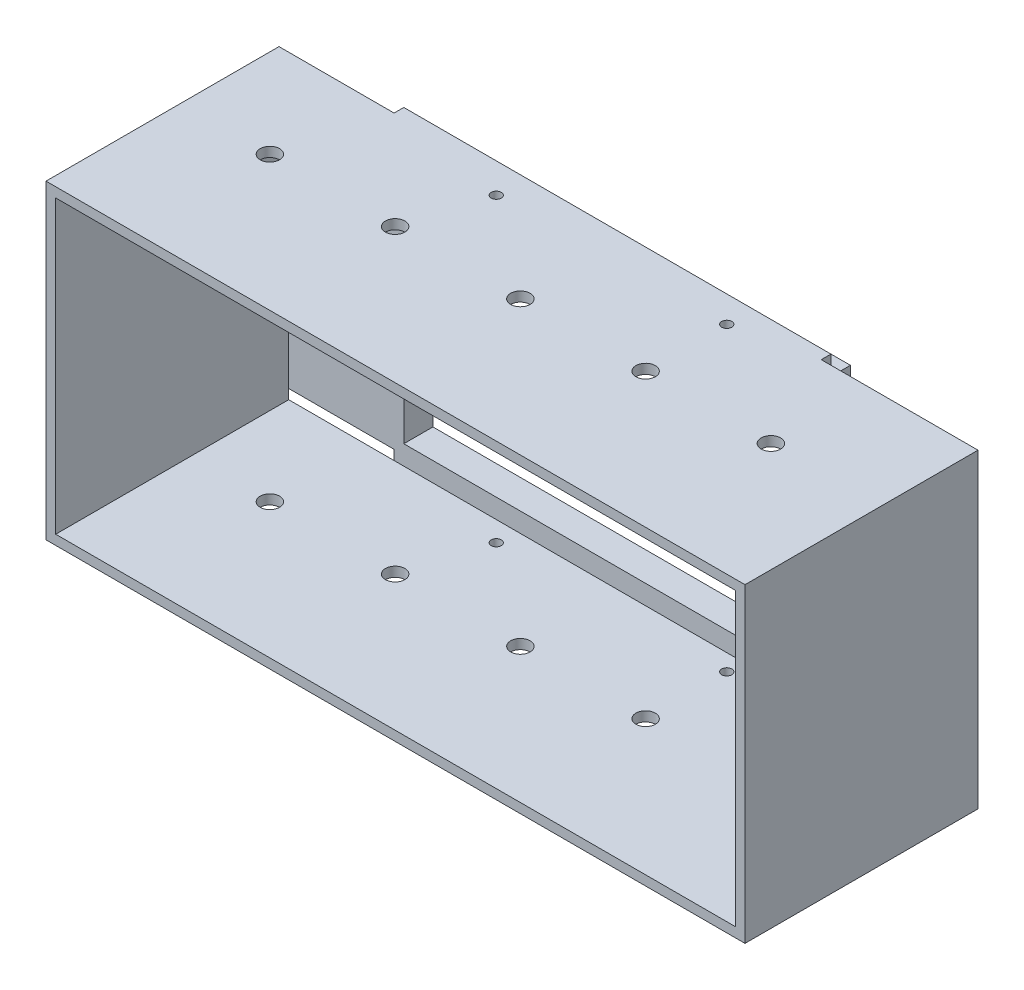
from build123d import *

# Parameters (mm, degrees)
SKETCH1_W           = 133.35
SKETCH1_H           = 82.55
BOSS_EXTRUDE1_DEPTH = 3.175
SKETCH3_W           = 139.7
SKETCH3_H           = 88.9
SKETCH3_W_2         = 133.35
SKETCH3_H_2         = 82.55
BOSS_EXTRUDE2_DEPTH = 6.35
SKETCH4_W           = 228.6
SKETCH4_H           = 101.6
SKETCH4_W_2         = 222.25
SKETCH4_H_2         = 95.25
BOSS_EXTRUDE3_DEPTH = 76.2
SKETCH8_R           = 3.175
SKETCH8_R_2         = 1.651
CUT_EXTRUDE1_DEPTH  = 138.938


with BuildPart() as part:
    # Sketch1 → Boss-Extrude1 (new body)
    with BuildSketch(Plane.XY):
        Polygon((-69.670771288, 35.885637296), (70.029228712, 35.885637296), (70.029228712, 29.535637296), (76.379228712, 29.535637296), (76.379228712, -59.364362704), (70.029228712, -59.364362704), (70.029228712, -65.714362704), (-69.670771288, -65.714362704), (-69.670771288, -59.364362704), (-107.315, -59.364362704), (-107.315, 29.535637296), (-69.670771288, 29.535637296), align=None)
        with Locations((0.179228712, -14.914362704)):
            Rectangle(SKETCH1_W, SKETCH1_H, mode=Mode.SUBTRACT)
    extrude(amount=BOSS_EXTRUDE1_DEPTH)

    # Sketch3 → Boss-Extrude2 (add)
    with BuildSketch(Plane(origin=(0, 0, 0), x_dir=(-1, 0, 0), z_dir=(0, 0, -1))):
        with Locations((-0.179228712, -14.914362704)):
            Rectangle(SKETCH3_W, SKETCH3_H)
        with Locations((-0.179228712, -14.914362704)):
            Rectangle(SKETCH3_W_2, SKETCH3_H_2, mode=Mode.SUBTRACT)
    extrude(amount=BOSS_EXTRUDE2_DEPTH)

    # Sketch4 → Boss-Extrude3 (add)
    with BuildSketch(Plane.XY.offset(3.175)):
        with Locations((6.985, -14.914362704)):
            Rectangle(SKETCH4_W, SKETCH4_H)
        with Locations((6.985, -14.914362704)):
            Rectangle(SKETCH4_W_2, SKETCH4_H_2, mode=Mode.SUBTRACT)
    extrude(amount=BOSS_EXTRUDE3_DEPTH)

    # Sketch8 → Cut-Extrude1 (cut)
    with BuildSketch(Plane.XZ.offset(65.714362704)):
        with Locations(Location((-78.32094587, 35.150571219, 0), (0, 0, 270))):
            Circle(SKETCH8_R)
        with Locations(Location((-37.359212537, 35.150571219, 0), (0, 0, 270))):
            Circle(SKETCH8_R)
        with Locations(Location((3.602520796, 35.150571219, 0), (0, 0, 270))):
            Circle(SKETCH8_R)
        with Locations(Location((44.56425413, 35.150571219, 0), (0, 0, 270))):
            Circle(SKETCH8_R)
        with Locations(Location((85.525987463, 35.150571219, 0), (0, 0, 270))):
            Circle(SKETCH8_R)
        with Locations(Location((-29.703073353, 9.750571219, 0), (0, 0, 270))):
            Circle(SKETCH8_R_2)
        with Locations(Location((44.56425413, 8.621785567, 0), (0, 0, 270))):
            Circle(SKETCH8_R_2)
    extrude(amount=-CUT_EXTRUDE1_DEPTH, mode=Mode.SUBTRACT)


solid = part.part
